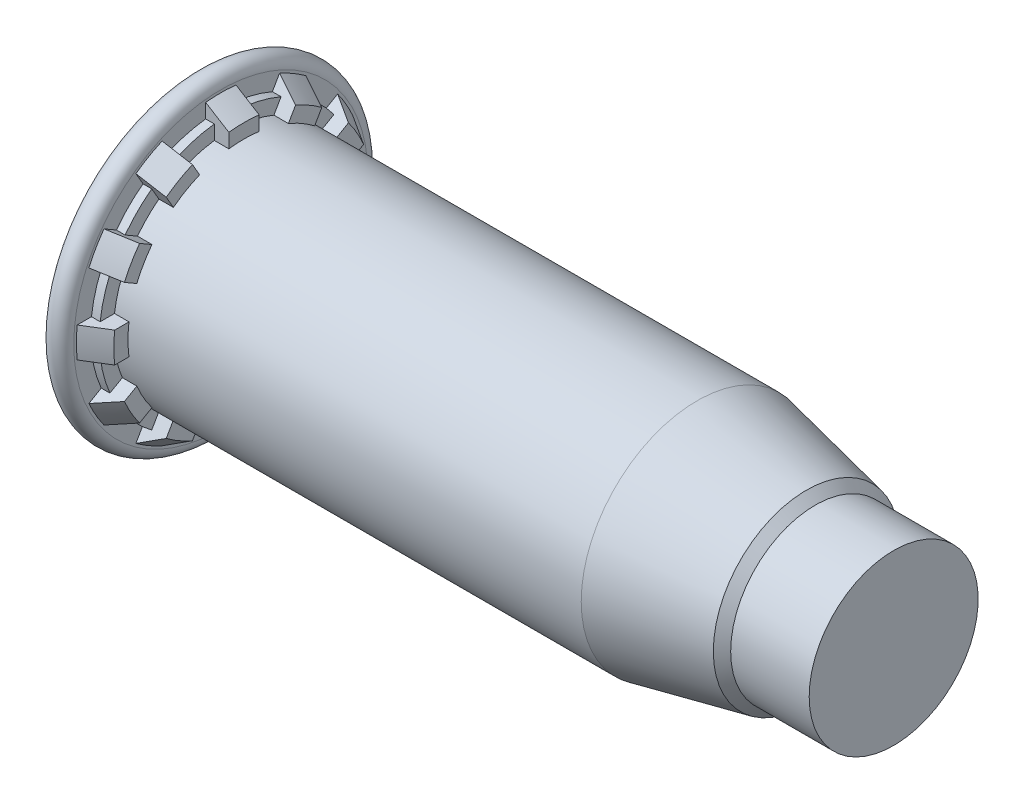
from build123d import *

# Parameters (mm, degrees)
RIBCUT1_DEPTH    = 0.375
RIBCUT2_DEPTH    = 0.6
RIBCUTSPAT_COUNT = 12
RIBCUTSPAT_ANGLE = 330


with BuildPart() as part:
    # BodySke → BaseBody (revolve)
    with BuildSketch(Plane.XY, mode=Mode.PRIVATE) as basebody_sk:
        with BuildLine():
            Line((0, 0), (0, 3.79746))
            Line((0, 3.79746), (0.00508, 3.79746))
            Line((0.00508, 3.79746), (0.00508, 3.80254))
            ThreePointArc((0.00508, 3.80254), (0.30254, 4.1), (0.6, 3.80254))
            Line((0.6, 3.80254), (0.6, 3.735))
            Line((0.6, 3.735), (1.2, 3.3675))
            Line((1.2, 3.3675), (1.2, 3))
            Line((1.2, 3), (12.92, 3))
            Line((12.92, 3), (15.7455, 2.4095))
            Line((15.7455, 2.4095), (15.97, 2.185))
            Line((15.97, 2.185), (18, 2.185))
            Line((18, 2.185), (18, 0))
            Line((18, 0), (0, 0))
        make_face()
    revolve(basebody_sk.sketch.rotate(Axis((0, 0, 0), (1, 0, 0)), 90), axis=Axis((0, 0, 0), (1, 0, 0)))

    # RibCut1Ske → RibCut1 (cut)
    with BuildSketch(Plane(origin=(1.2, 0, 0), x_dir=(0, 0, -1), z_dir=(1, 0, 0))):
        with BuildLine():
            Line((0.391578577, 2.974334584), (0.391578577, 4.081257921))
            ThreePointArc((0.391578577, 4.081257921), (1.061158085, 3.960295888), (1.701511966, 3.730262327))
            Line((1.701511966, 3.730262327), (1.148050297, 2.771638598))
            ThreePointArc((1.148050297, 2.771638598), (0.776457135, 2.897777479), (0.391578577, 2.974334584))
        make_face()
    ribcut1 = extrude(amount=-RIBCUT1_DEPTH, mode=Mode.SUBTRACT)

    # RibCut2Ske → RibCut2 (cut)
    with BuildSketch(Plane(origin=(1.2, 0, 0), x_dir=(0, 0, -1), z_dir=(1, 0, 0))):
        with BuildLine():
            Line((0.391578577, 3.344655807), (0.391578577, 4.081257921))
            ThreePointArc((0.391578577, 4.081257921), (1.061158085, 3.960295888), (1.701511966, 3.730262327))
            Line((1.701511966, 3.730262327), (1.333210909, 3.092346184))
            ThreePointArc((1.333210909, 3.092346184), (0.871573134, 3.25275522), (0.391578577, 3.344655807))
        make_face()
    ribcut2 = extrude(amount=-RIBCUT2_DEPTH, mode=Mode.SUBTRACT)

    # RibCutsPat: RibCut1, RibCut2 ×12 about axis
    ribcutspat_axis = Axis((0, 0, 0), (1, 0, 0))
    add([ribcut1.rotate(ribcutspat_axis, i * RIBCUTSPAT_ANGLE / (RIBCUTSPAT_COUNT - 1)) for i in range(1, RIBCUTSPAT_COUNT)], mode=Mode.SUBTRACT)
    add([ribcut2.rotate(ribcutspat_axis, i * RIBCUTSPAT_ANGLE / (RIBCUTSPAT_COUNT - 1)) for i in range(1, RIBCUTSPAT_COUNT)], mode=Mode.SUBTRACT)


solid = part.part
